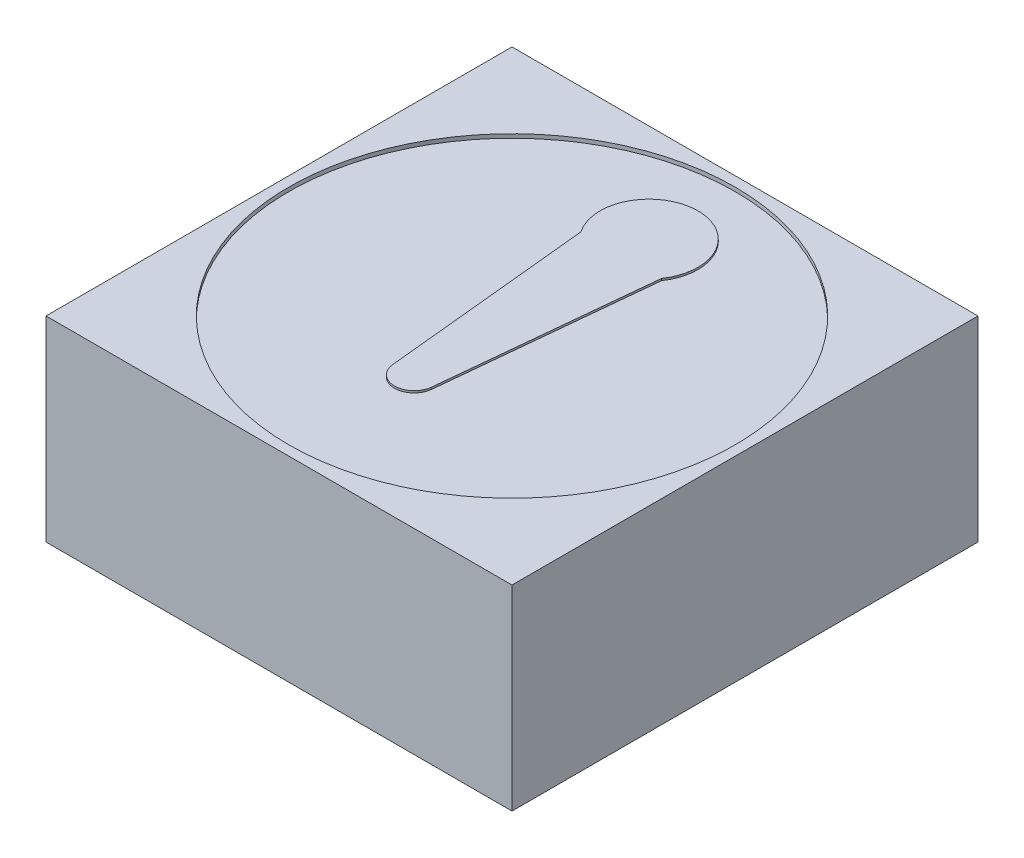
from build123d import *

# Parameters (mm, degrees)
ESQUISSE1_W             = 2.38
ESQUISSE1_H             = 2.38
BOSS_EXTRU_1_DEPTH      = 1
ESQUISSE2_R             = 1.14
ENL_V_MAT_EXTRU_1_DEPTH = 0.2
BOSS_EXTRU_2_START      = 0.18
ESQUISSE3_R             = 1.14
BOSS_EXTRU_2_DEPTH      = 0.18
BOSS_EXTRU_3_DEPTH      = 0.01


with BuildPart() as part:
    # Esquisse1 → Boss.-Extru.1 (new body)
    with BuildSketch(Plane(origin=(0, 0, 0), x_dir=(1, 0, 0), z_dir=(0, 1, 0))):
        Rectangle(ESQUISSE1_W, ESQUISSE1_H)
    extrude(amount=BOSS_EXTRU_1_DEPTH)

    # Esquisse2 → Enl_v. mat.-Extru.1 (cut)
    with BuildSketch(Plane(origin=(0, 1, 0), x_dir=(1, 0, 0), z_dir=(0, 1, 0))):
        with Locations(Location((0, 0, 0), (0, 0, 270))):
            Circle(ESQUISSE2_R)
    extrude(amount=-ENL_V_MAT_EXTRU_1_DEPTH, mode=Mode.SUBTRACT)

    # Esquisse3 → Boss.-Extru.2 (add)
    with BuildSketch(Plane(origin=(0, 0.8, 0), x_dir=(1, 0, 0), z_dir=(0, 1, 0)).offset(BOSS_EXTRU_2_START)):
        with Locations(Location((0, 0, 0), (0, 0, 270))):
            Circle(ESQUISSE3_R)
    extrude(amount=-BOSS_EXTRU_2_DEPTH)

    # Esquisse4 → Boss.-Extru.3 (add)
    with BuildSketch(Plane(origin=(0, 0.98, 0), x_dir=(1, 0, 0), z_dir=(0, 1, 0))):
        with BuildLine():
            Line((-0.099506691, -0.509920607), (-0.206013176, 0.558371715))
            ThreePointArc((-0.206013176, 0.558371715), (0, 0.95), (0.206013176, 0.558371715))
            Line((0.206013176, 0.558371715), (0.099506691, -0.509920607))
            ThreePointArc((0.099506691, -0.509920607), (0, -0.6), (-0.099506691, -0.509920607))
        make_face()
    extrude(amount=BOSS_EXTRU_3_DEPTH)


solid = part.part
